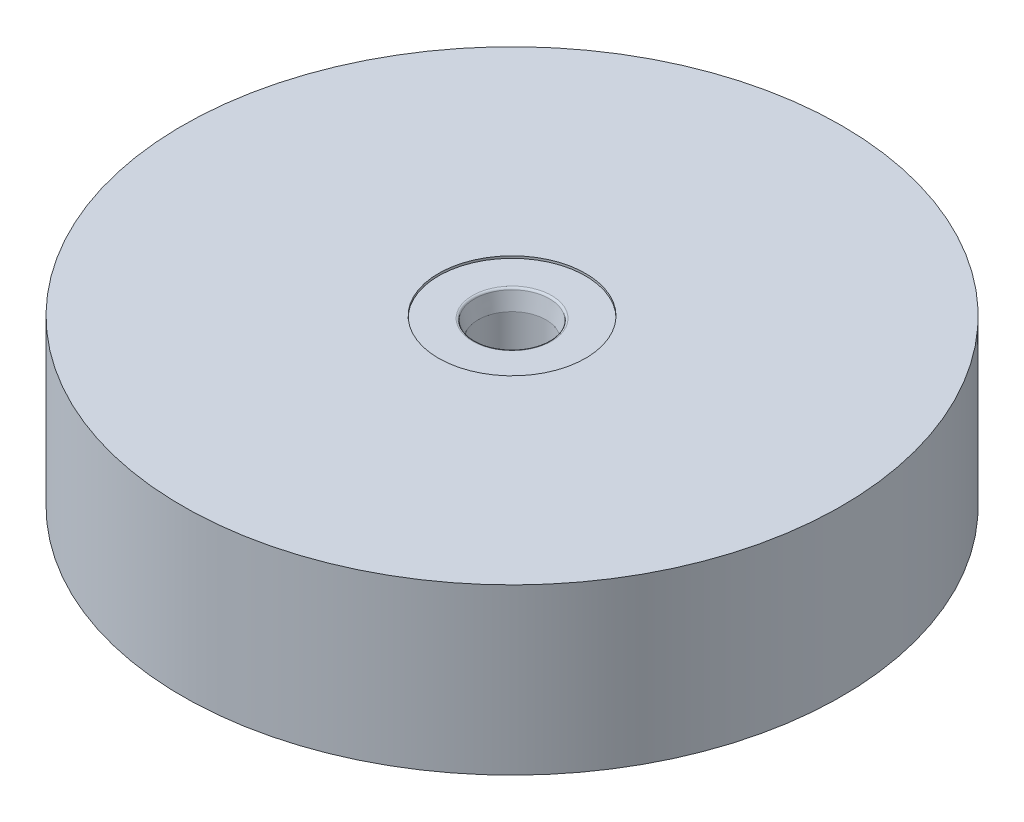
ISO-10303-21;
HEADER;
FILE_DESCRIPTION(('STEP AP214'),'2;1');
FILE_NAME('part.step','',(''),(''),'','','');
FILE_SCHEMA(('AUTOMOTIVE_DESIGN { 1 0 10303 214 1 1 1 1 }'));
ENDSEC;
DATA;
#1=APPLICATION_CONTEXT('core data for automotive mechanical design processes');
#2=APPLICATION_PROTOCOL_DEFINITION('international standard','automotive_design',2000,#1);
#3=PRODUCT_CONTEXT('',#1,'mechanical');
#4=PRODUCT('Part','Part','',(#3));
#5=PRODUCT_RELATED_PRODUCT_CATEGORY('part','',(#4));
#6=PRODUCT_DEFINITION_FORMATION('','',#4);
#7=PRODUCT_DEFINITION_CONTEXT('part definition',#1,'design');
#8=PRODUCT_DEFINITION('design','',#6,#7);
#9=PRODUCT_DEFINITION_SHAPE('','',#8);
#10=(LENGTH_UNIT() NAMED_UNIT(*) SI_UNIT(.MILLI.,.METRE.));
#11=(NAMED_UNIT(*) PLANE_ANGLE_UNIT() SI_UNIT($,.RADIAN.));
#12=(NAMED_UNIT(*) SI_UNIT($,.STERADIAN.) SOLID_ANGLE_UNIT());
#13=UNCERTAINTY_MEASURE_WITH_UNIT(LENGTH_MEASURE(1.E-05),#10,'distance_accuracy_value','');
#14=(GEOMETRIC_REPRESENTATION_CONTEXT(3) GLOBAL_UNCERTAINTY_ASSIGNED_CONTEXT((#13)) GLOBAL_UNIT_ASSIGNED_CONTEXT((#10,
#11,#12)) REPRESENTATION_CONTEXT('',''));
#15=CARTESIAN_POINT('',(0.,0.,0.));
#16=DIRECTION('',(0.,0.,1.));
#17=DIRECTION('',(1.,0.,0.));
#18=AXIS2_PLACEMENT_3D('',#15,#16,#17);
#19=CARTESIAN_POINT('',(-38.1,-19.05,0.));
#20=DIRECTION('',(0.,1.,0.));
#21=DIRECTION('',(0.,0.,1.));
#22=AXIS2_PLACEMENT_3D('',#19,#20,#21);
#23=PLANE('',#22);
#24=CARTESIAN_POINT('',(0.,-19.05,0.));
#25=DIRECTION('',(0.,1.,0.));
#26=DIRECTION('',(0.,0.,1.));
#27=AXIS2_PLACEMENT_3D('',#24,#25,#26);
#28=CIRCLE('',#27,3.4544);
#29=CARTESIAN_POINT('',(0.,-19.05,3.4544));
#30=VERTEX_POINT('',#29);
#31=EDGE_CURVE('E52',#30,#30,#28,.T.);
#32=ORIENTED_EDGE('',*,*,#31,.T.);
#33=EDGE_LOOP('',(#32));
#34=FACE_BOUND('',#33,.T.);
#35=CARTESIAN_POINT('',(0.,-19.05,0.));
#36=DIRECTION('',(0.,-1.,0.));
#37=DIRECTION('',(0.,0.,-1.));
#38=AXIS2_PLACEMENT_3D('',#35,#36,#37);
#39=CIRCLE('',#38,8.5598);
#40=CARTESIAN_POINT('',(0.,-19.05,8.5598));
#41=VERTEX_POINT('',#40);
#42=EDGE_CURVE('E85',#41,#41,#39,.T.);
#43=ORIENTED_EDGE('',*,*,#42,.T.);
#44=EDGE_LOOP('',(#43));
#45=FACE_BOUND('',#44,.T.);
#46=ADVANCED_FACE('F34',(#34,#45),#23,.F.);
#47=CARTESIAN_POINT('',(0.,0.,0.));
#48=DIRECTION('',(0.,-1.,0.));
#49=DIRECTION('',(0.,0.,-1.));
#50=AXIS2_PLACEMENT_3D('',#47,#48,#49);
#51=PLANE('',#50);
#52=CARTESIAN_POINT('',(0.,0.,0.));
#53=DIRECTION('',(0.,1.,0.));
#54=DIRECTION('',(0.,0.,1.));
#55=AXIS2_PLACEMENT_3D('',#52,#53,#54);
#56=CIRCLE('',#55,8.5);
#57=CARTESIAN_POINT('',(0.,0.,8.5));
#58=VERTEX_POINT('',#57);
#59=EDGE_CURVE('E56',#58,#58,#56,.T.);
#60=ORIENTED_EDGE('',*,*,#59,.F.);
#61=EDGE_LOOP('',(#60));
#62=FACE_BOUND('',#61,.T.);
#63=CARTESIAN_POINT('',(0.,0.,0.));
#64=DIRECTION('',(0.,-1.,0.));
#65=DIRECTION('',(0.,0.,-1.));
#66=AXIS2_PLACEMENT_3D('',#63,#64,#65);
#67=CIRCLE('',#66,38.1);
#68=CARTESIAN_POINT('',(0.,0.,-38.1));
#69=VERTEX_POINT('',#68);
#70=EDGE_CURVE('E49',#69,#69,#67,.T.);
#71=ORIENTED_EDGE('',*,*,#70,.F.);
#72=EDGE_LOOP('',(#71));
#73=FACE_BOUND('',#72,.T.);
#74=ADVANCED_FACE('F109',(#62,#73),#51,.F.);
#75=CARTESIAN_POINT('',(0.,0.,0.));
#76=DIRECTION('',(0.,-1.,0.));
#77=DIRECTION('',(0.,0.,-1.));
#78=AXIS2_PLACEMENT_3D('',#75,#76,#77);
#79=CYLINDRICAL_SURFACE('',#78,38.1);
#80=CARTESIAN_POINT('',(0.,-19.05,0.));
#81=DIRECTION('',(0.,-1.,0.));
#82=DIRECTION('',(0.,0.,-1.));
#83=AXIS2_PLACEMENT_3D('',#80,#81,#82);
#84=CIRCLE('',#83,38.1);
#85=CARTESIAN_POINT('',(0.,-19.05,-38.1));
#86=VERTEX_POINT('',#85);
#87=EDGE_CURVE('E55',#86,#86,#84,.T.);
#88=ORIENTED_EDGE('',*,*,#87,.F.);
#89=EDGE_LOOP('',(#88));
#90=FACE_BOUND('',#89,.T.);
#91=ORIENTED_EDGE('',*,*,#70,.T.);
#92=EDGE_LOOP('',(#91));
#93=FACE_BOUND('',#92,.T.);
#94=ADVANCED_FACE('F116',(#90,#93),#79,.T.);
#95=CARTESIAN_POINT('',(0.,-19.05,0.));
#96=DIRECTION('',(0.,1.,0.));
#97=DIRECTION('',(0.,0.,1.));
#98=AXIS2_PLACEMENT_3D('',#95,#96,#97);
#99=CIRCLE('',#98,10.668);
#100=CARTESIAN_POINT('',(0.,-19.05,10.668));
#101=VERTEX_POINT('',#100);
#102=EDGE_CURVE('E45',#101,#101,#99,.F.);
#103=ORIENTED_EDGE('',*,*,#102,.F.);
#104=EDGE_LOOP('',(#103));
#105=FACE_BOUND('',#104,.T.);
#106=ORIENTED_EDGE('',*,*,#87,.T.);
#107=EDGE_LOOP('',(#106));
#108=FACE_BOUND('',#107,.T.);
#109=ADVANCED_FACE('F112',(#105,#108),#23,.F.);
#110=CARTESIAN_POINT('',(0.,0.,0.));
#111=DIRECTION('',(0.,1.,0.));
#112=DIRECTION('',(0.,0.,1.));
#113=AXIS2_PLACEMENT_3D('',#110,#111,#112);
#114=CYLINDRICAL_SURFACE('',#113,3.4544);
#115=CARTESIAN_POINT('',(0.,-10.254,0.));
#116=DIRECTION('',(0.,1.,0.));
#117=DIRECTION('',(0.,0.,1.));
#118=AXIS2_PLACEMENT_3D('',#115,#116,#117);
#119=CIRCLE('',#118,3.4544);
#120=CARTESIAN_POINT('',(0.,-10.254,3.4544));
#121=VERTEX_POINT('',#120);
#122=EDGE_CURVE('E81',#121,#121,#119,.T.);
#123=ORIENTED_EDGE('',*,*,#122,.T.);
#124=EDGE_LOOP('',(#123));
#125=FACE_BOUND('',#124,.T.);
#126=ORIENTED_EDGE('',*,*,#31,.F.);
#127=EDGE_LOOP('',(#126));
#128=FACE_BOUND('',#127,.T.);
#129=ADVANCED_FACE('F122',(#125,#128),#114,.F.);
#130=CARTESIAN_POINT('',(0.,0.,0.));
#131=DIRECTION('',(0.,1.,0.));
#132=DIRECTION('',(0.,0.,1.));
#133=AXIS2_PLACEMENT_3D('',#130,#131,#132);
#134=CYLINDRICAL_SURFACE('',#133,8.5);
#135=CARTESIAN_POINT('',(0.,-0.254000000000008,0.));
#136=DIRECTION('',(0.,1.,0.));
#137=DIRECTION('',(0.,0.,1.));
#138=AXIS2_PLACEMENT_3D('',#135,#136,#137);
#139=CIRCLE('',#138,8.5);
#140=CARTESIAN_POINT('',(0.,-0.254000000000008,8.5));
#141=VERTEX_POINT('',#140);
#142=EDGE_CURVE('E63',#141,#141,#139,.T.);
#143=ORIENTED_EDGE('',*,*,#142,.F.);
#144=EDGE_LOOP('',(#143));
#145=FACE_BOUND('',#144,.T.);
#146=ORIENTED_EDGE('',*,*,#59,.T.);
#147=EDGE_LOOP('',(#146));
#148=FACE_BOUND('',#147,.T.);
#149=ADVANCED_FACE('F128',(#145,#148),#134,.F.);
#150=CARTESIAN_POINT('',(-3.939792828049,-0.254000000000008,-2.32565205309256));
#151=DIRECTION('',(0.,-1.,0.));
#152=DIRECTION('',(0.,0.,-1.));
#153=AXIS2_PLACEMENT_3D('',#150,#151,#152);
#154=PLANE('',#153);
#155=CARTESIAN_POINT('',(0.,-0.254000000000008,0.));
#156=DIRECTION('',(0.,1.,0.));
#157=DIRECTION('',(0.,0.,1.));
#158=AXIS2_PLACEMENT_3D('',#155,#156,#157);
#159=CIRCLE('',#158,4.575);
#160=CARTESIAN_POINT('',(0.,-0.254000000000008,4.575));
#161=VERTEX_POINT('',#160);
#162=EDGE_CURVE('E66',#161,#161,#159,.T.);
#163=ORIENTED_EDGE('',*,*,#162,.F.);
#164=EDGE_LOOP('',(#163));
#165=FACE_BOUND('',#164,.T.);
#166=ORIENTED_EDGE('',*,*,#142,.T.);
#167=EDGE_LOOP('',(#166));
#168=FACE_BOUND('',#167,.T.);
#169=ADVANCED_FACE('F162',(#165,#168),#154,.F.);
#170=CARTESIAN_POINT('',(0.,-0.508000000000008,0.));
#171=DIRECTION('',(0.,1.,0.));
#172=DIRECTION('',(0.,0.,1.));
#173=AXIS2_PLACEMENT_3D('',#170,#171,#172);
#174=TOROIDAL_SURFACE('',#173,4.575,0.254);
#175=CARTESIAN_POINT('',(0.,-0.455190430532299,0.));
#176=DIRECTION('',(0.,1.,0.));
#177=DIRECTION('',(0.,0.,1.));
#178=AXIS2_PLACEMENT_3D('',#175,#176,#177);
#179=CIRCLE('',#178,4.32655050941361);
#180=CARTESIAN_POINT('',(0.,-0.455190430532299,4.32655050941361));
#181=VERTEX_POINT('',#180);
#182=EDGE_CURVE('E69',#181,#181,#179,.T.);
#183=ORIENTED_EDGE('',*,*,#182,.F.);
#184=EDGE_LOOP('',(#183));
#185=FACE_BOUND('',#184,.T.);
#186=ORIENTED_EDGE('',*,*,#162,.T.);
#187=EDGE_LOOP('',(#186));
#188=FACE_BOUND('',#187,.T.);
#189=ADVANCED_FACE('F174',(#185,#188),#174,.T.);
#190=CARTESIAN_POINT('',(0.,-0.455190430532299,0.));
#191=DIRECTION('',(0.,1.,0.));
#192=DIRECTION('',(0.,0.,1.));
#193=AXIS2_PLACEMENT_3D('',#190,#191,#192);
#194=CONICAL_SURFACE('',#193,4.32655050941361,0.209439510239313);
#195=CARTESIAN_POINT('',(0.,-2.35400000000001,0.));
#196=DIRECTION('',(0.,1.,0.));
#197=DIRECTION('',(0.,0.,1.));
#198=AXIS2_PLACEMENT_3D('',#195,#196,#197);
#199=CIRCLE('',#198,3.92294607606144);
#200=CARTESIAN_POINT('',(0.,-2.35400000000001,3.92294607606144));
#201=VERTEX_POINT('',#200);
#202=EDGE_CURVE('E72',#201,#201,#199,.T.);
#203=ORIENTED_EDGE('',*,*,#202,.F.);
#204=EDGE_LOOP('',(#203));
#205=FACE_BOUND('',#204,.T.);
#206=ORIENTED_EDGE('',*,*,#182,.T.);
#207=EDGE_LOOP('',(#206));
#208=FACE_BOUND('',#207,.T.);
#209=ADVANCED_FACE('F185',(#205,#208),#194,.F.);
#210=CARTESIAN_POINT('',(0.,-2.35400000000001,0.));
#211=DIRECTION('',(0.,1.,0.));
#212=DIRECTION('',(0.,0.,1.));
#213=AXIS2_PLACEMENT_3D('',#210,#211,#212);
#214=CONICAL_SURFACE('',#213,3.92294607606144,0.785398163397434);
#215=CARTESIAN_POINT('',(0.,-2.30819607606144,0.));
#216=DIRECTION('',(0.,1.,0.));
#217=DIRECTION('',(0.,0.,1.));
#218=AXIS2_PLACEMENT_3D('',#215,#216,#217);
#219=CIRCLE('',#218,3.96875);
#220=CARTESIAN_POINT('',(0.,-2.30819607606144,3.96875));
#221=VERTEX_POINT('',#220);
#222=EDGE_CURVE('E75',#221,#221,#219,.T.);
#223=ORIENTED_EDGE('',*,*,#222,.F.);
#224=EDGE_LOOP('',(#223));
#225=FACE_BOUND('',#224,.T.);
#226=ORIENTED_EDGE('',*,*,#202,.T.);
#227=EDGE_LOOP('',(#226));
#228=FACE_BOUND('',#227,.T.);
#229=ADVANCED_FACE('F196',(#225,#228),#214,.T.);
#230=CARTESIAN_POINT('',(0.,0.,0.));
#231=DIRECTION('',(0.,1.,0.));
#232=DIRECTION('',(0.,0.,1.));
#233=AXIS2_PLACEMENT_3D('',#230,#231,#232);
#234=CYLINDRICAL_SURFACE('',#233,3.96875);
#235=CARTESIAN_POINT('',(0.,-10.254,0.));
#236=DIRECTION('',(0.,1.,0.));
#237=DIRECTION('',(0.,0.,1.));
#238=AXIS2_PLACEMENT_3D('',#235,#236,#237);
#239=CIRCLE('',#238,3.96875);
#240=CARTESIAN_POINT('',(0.,-10.254,3.96875));
#241=VERTEX_POINT('',#240);
#242=EDGE_CURVE('E78',#241,#241,#239,.T.);
#243=ORIENTED_EDGE('',*,*,#242,.F.);
#244=EDGE_LOOP('',(#243));
#245=FACE_BOUND('',#244,.T.);
#246=ORIENTED_EDGE('',*,*,#222,.T.);
#247=EDGE_LOOP('',(#246));
#248=FACE_BOUND('',#247,.T.);
#249=ADVANCED_FACE('F104',(#245,#248),#234,.F.);
#250=CARTESIAN_POINT('',(-2.97478040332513,-10.254,-1.75600709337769));
#251=DIRECTION('',(0.,-1.,0.));
#252=DIRECTION('',(0.,0.,-1.));
#253=AXIS2_PLACEMENT_3D('',#250,#251,#252);
#254=PLANE('',#253);
#255=ORIENTED_EDGE('',*,*,#122,.F.);
#256=EDGE_LOOP('',(#255));
#257=FACE_BOUND('',#256,.T.);
#258=ORIENTED_EDGE('',*,*,#242,.T.);
#259=EDGE_LOOP('',(#258));
#260=FACE_BOUND('',#259,.T.);
#261=ADVANCED_FACE('F97',(#257,#260),#254,.F.);
#262=CARTESIAN_POINT('',(0.,-38.1,0.));
#263=DIRECTION('',(0.,-1.,0.));
#264=DIRECTION('',(0.,0.,-1.));
#265=AXIS2_PLACEMENT_3D('',#262,#263,#264);
#266=PLANE('',#265);
#267=CARTESIAN_POINT('',(0.,-38.1,0.));
#268=DIRECTION('',(0.,-1.,0.));
#269=DIRECTION('',(0.,0.,-1.));
#270=AXIS2_PLACEMENT_3D('',#267,#268,#269);
#271=CIRCLE('',#270,9.39800000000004);
#272=CARTESIAN_POINT('',(0.,-38.1,9.39800000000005));
#273=VERTEX_POINT('',#272);
#274=EDGE_CURVE('E41',#273,#273,#271,.T.);
#275=ORIENTED_EDGE('',*,*,#274,.T.);
#276=EDGE_LOOP('',(#275));
#277=FACE_BOUND('',#276,.T.);
#278=CARTESIAN_POINT('',(0.,-38.1,0.));
#279=DIRECTION('',(0.,-1.,0.));
#280=DIRECTION('',(0.,0.,-1.));
#281=AXIS2_PLACEMENT_3D('',#278,#279,#280);
#282=CIRCLE('',#281,8.5598);
#283=CARTESIAN_POINT('',(0.,-38.1,8.5598));
#284=VERTEX_POINT('',#283);
#285=EDGE_CURVE('E84',#284,#284,#282,.T.);
#286=ORIENTED_EDGE('',*,*,#285,.F.);
#287=EDGE_LOOP('',(#286));
#288=FACE_BOUND('',#287,.T.);
#289=ADVANCED_FACE('F94',(#277,#288),#266,.T.);
#290=CARTESIAN_POINT('',(0.,-38.1,0.));
#291=DIRECTION('',(0.,1.,0.));
#292=DIRECTION('',(0.,0.,1.));
#293=AXIS2_PLACEMENT_3D('',#290,#291,#292);
#294=CYLINDRICAL_SURFACE('',#293,10.668);
#295=CARTESIAN_POINT('',(0.,-36.83,0.));
#296=DIRECTION('',(0.,-1.,0.));
#297=DIRECTION('',(0.,0.,-1.));
#298=AXIS2_PLACEMENT_3D('',#295,#296,#297);
#299=CIRCLE('',#298,10.668);
#300=CARTESIAN_POINT('',(0.,-36.83,10.668));
#301=VERTEX_POINT('',#300);
#302=EDGE_CURVE('E10',#301,#301,#299,.F.);
#303=CARTESIAN_POINT('',(0.,-36.83,10.668));
#304=CARTESIAN_POINT('',(0.,-36.6447916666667,10.668));
#305=CARTESIAN_POINT('',(0.,-36.4595833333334,10.668));
#306=CARTESIAN_POINT('',(0.,-36.0891666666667,10.668));
#307=CARTESIAN_POINT('',(0.,-35.9039583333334,10.668));
#308=CARTESIAN_POINT('',(0.,-35.5335416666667,10.668));
#309=CARTESIAN_POINT('',(0.,-35.3483333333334,10.668));
#310=CARTESIAN_POINT('',(0.,-34.9779166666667,10.668));
#311=CARTESIAN_POINT('',(0.,-34.7927083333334,10.668));
#312=CARTESIAN_POINT('',(0.,-34.4222916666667,10.668));
#313=CARTESIAN_POINT('',(0.,-34.2370833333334,10.668));
#314=CARTESIAN_POINT('',(0.,-33.8666666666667,10.668));
#315=CARTESIAN_POINT('',(0.,-33.6814583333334,10.668));
#316=CARTESIAN_POINT('',(0.,-33.3110416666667,10.668));
#317=CARTESIAN_POINT('',(0.,-33.1258333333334,10.668));
#318=CARTESIAN_POINT('',(0.,-32.7554166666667,10.668));
#319=CARTESIAN_POINT('',(0.,-32.5702083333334,10.668));
#320=CARTESIAN_POINT('',(0.,-32.1997916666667,10.668));
#321=CARTESIAN_POINT('',(0.,-32.0145833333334,10.668));
#322=CARTESIAN_POINT('',(0.,-31.6441666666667,10.668));
#323=CARTESIAN_POINT('',(0.,-31.4589583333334,10.668));
#324=CARTESIAN_POINT('',(0.,-31.0885416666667,10.668));
#325=CARTESIAN_POINT('',(0.,-30.9033333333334,10.668));
#326=CARTESIAN_POINT('',(0.,-30.5329166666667,10.668));
#327=CARTESIAN_POINT('',(0.,-30.3477083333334,10.668));
#328=CARTESIAN_POINT('',(0.,-29.9772916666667,10.668));
#329=CARTESIAN_POINT('',(0.,-29.7920833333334,10.668));
#330=CARTESIAN_POINT('',(0.,-29.4216666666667,10.668));
#331=CARTESIAN_POINT('',(0.,-29.2364583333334,10.668));
#332=CARTESIAN_POINT('',(0.,-28.8660416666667,10.668));
#333=CARTESIAN_POINT('',(0.,-28.6808333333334,10.668));
#334=CARTESIAN_POINT('',(0.,-28.3104166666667,10.668));
#335=CARTESIAN_POINT('',(0.,-28.1252083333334,10.668));
#336=CARTESIAN_POINT('',(0.,-27.7547916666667,10.668));
#337=CARTESIAN_POINT('',(0.,-27.5695833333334,10.668));
#338=CARTESIAN_POINT('',(0.,-27.1991666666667,10.668));
#339=CARTESIAN_POINT('',(0.,-27.0139583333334,10.668));
#340=CARTESIAN_POINT('',(0.,-26.6435416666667,10.668));
#341=CARTESIAN_POINT('',(0.,-26.4583333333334,10.668));
#342=CARTESIAN_POINT('',(0.,-26.0879166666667,10.668));
#343=CARTESIAN_POINT('',(0.,-25.9027083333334,10.668));
#344=CARTESIAN_POINT('',(0.,-25.5322916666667,10.668));
#345=CARTESIAN_POINT('',(0.,-25.3470833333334,10.668));
#346=CARTESIAN_POINT('',(0.,-24.9766666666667,10.668));
#347=CARTESIAN_POINT('',(0.,-24.7914583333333,10.668));
#348=CARTESIAN_POINT('',(0.,-24.4210416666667,10.668));
#349=CARTESIAN_POINT('',(0.,-24.2358333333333,10.668));
#350=CARTESIAN_POINT('',(0.,-23.8654166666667,10.668));
#351=CARTESIAN_POINT('',(0.,-23.6802083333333,10.668));
#352=CARTESIAN_POINT('',(0.,-23.3097916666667,10.668));
#353=CARTESIAN_POINT('',(0.,-23.1245833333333,10.668));
#354=CARTESIAN_POINT('',(0.,-22.7541666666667,10.668));
#355=CARTESIAN_POINT('',(0.,-22.5689583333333,10.668));
#356=CARTESIAN_POINT('',(0.,-22.1985416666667,10.668));
#357=CARTESIAN_POINT('',(0.,-22.0133333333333,10.668));
#358=CARTESIAN_POINT('',(0.,-21.6429166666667,10.668));
#359=CARTESIAN_POINT('',(0.,-21.4577083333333,10.668));
#360=CARTESIAN_POINT('',(0.,-21.0872916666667,10.668));
#361=CARTESIAN_POINT('',(0.,-20.9020833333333,10.668));
#362=CARTESIAN_POINT('',(0.,-20.5316666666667,10.668));
#363=CARTESIAN_POINT('',(0.,-20.3464583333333,10.668));
#364=CARTESIAN_POINT('',(0.,-19.9760416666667,10.668));
#365=CARTESIAN_POINT('',(0.,-19.7908333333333,10.668));
#366=CARTESIAN_POINT('',(0.,-19.4204166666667,10.668));
#367=CARTESIAN_POINT('',(0.,-19.2352083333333,10.668));
#368=CARTESIAN_POINT('',(0.,-19.05,10.668));
#369=B_SPLINE_CURVE_WITH_KNOTS('',3,(#303,#304,#305,#306,#307,#308,#309,#310,#311,#312,#313,
#314,#315,#316,#317,#318,#319,#320,#321,#322,#323,#324,#325,#326,#327,#328,#329,#330,#331,#332,
#333,#334,#335,#336,#337,#338,#339,#340,#341,#342,#343,#344,#345,#346,#347,#348,#349,#350,#351,
#352,#353,#354,#355,#356,#357,#358,#359,#360,#361,#362,#363,#364,#365,#366,#367,#368),
.UNSPECIFIED.,.F.,.F.,(4,2,2,2,2,2,2,2,2,2,2,2,2,2,2,2,2,2,2,2,2,2,2,2,2,2,2,2,2,2,2,2,4),(0.,
0.555624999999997,1.11125,1.666875,2.2225,2.778125,3.33375,3.88937500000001,4.445,
5.00062500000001,5.55625000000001,6.11187500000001,6.66750000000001,7.22312500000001,
7.77875000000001,8.33437500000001,8.89000000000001,9.44562500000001,10.00125,10.556875,11.1125,
11.668125,12.22375,12.779375,13.335,13.890625,14.44625,15.001875,15.5575,16.113125,16.66875,
17.224375,17.78),.UNSPECIFIED.);
#370=EDGE_CURVE('BSEAM96',#301,#101,#369,.T.);
#371=ORIENTED_EDGE('',*,*,#302,.T.);
#372=ORIENTED_EDGE('',*,*,#102,.T.);
#373=ORIENTED_EDGE('',*,*,#370,.T.);
#374=ORIENTED_EDGE('',*,*,#370,.F.);
#375=EDGE_LOOP('',(#371,#373,#372,#374));
#376=FACE_BOUND('',#375,.T.);
#377=ADVANCED_FACE('F96',(#376),#294,.T.);
#378=CARTESIAN_POINT('',(0.,-38.1,0.));
#379=DIRECTION('',(0.,1.,0.));
#380=DIRECTION('',(0.,0.,1.));
#381=AXIS2_PLACEMENT_3D('',#378,#379,#380);
#382=CYLINDRICAL_SURFACE('',#381,8.5598);
#383=CARTESIAN_POINT('',(0.,-38.1,8.5598));
#384=CARTESIAN_POINT('',(0.,-37.9015625,8.5598));
#385=CARTESIAN_POINT('',(0.,-37.703125,8.5598));
#386=CARTESIAN_POINT('',(0.,-37.30625,8.5598));
#387=CARTESIAN_POINT('',(0.,-37.1078125,8.5598));
#388=CARTESIAN_POINT('',(0.,-36.7109375,8.5598));
#389=CARTESIAN_POINT('',(0.,-36.5125,8.5598));
#390=CARTESIAN_POINT('',(0.,-36.115625,8.5598));
#391=CARTESIAN_POINT('',(0.,-35.9171875,8.5598));
#392=CARTESIAN_POINT('',(0.,-35.5203125,8.5598));
#393=CARTESIAN_POINT('',(0.,-35.321875,8.5598));
#394=CARTESIAN_POINT('',(0.,-34.925,8.5598));
#395=CARTESIAN_POINT('',(0.,-34.7265625,8.5598));
#396=CARTESIAN_POINT('',(0.,-34.3296875,8.5598));
#397=CARTESIAN_POINT('',(0.,-34.13125,8.5598));
#398=CARTESIAN_POINT('',(0.,-33.734375,8.5598));
#399=CARTESIAN_POINT('',(0.,-33.5359375,8.5598));
#400=CARTESIAN_POINT('',(0.,-33.1390625,8.5598));
#401=CARTESIAN_POINT('',(0.,-32.940625,8.5598));
#402=CARTESIAN_POINT('',(0.,-32.54375,8.5598));
#403=CARTESIAN_POINT('',(0.,-32.3453125,8.5598));
#404=CARTESIAN_POINT('',(0.,-31.9484375,8.5598));
#405=CARTESIAN_POINT('',(0.,-31.75,8.5598));
#406=CARTESIAN_POINT('',(0.,-31.353125,8.5598));
#407=CARTESIAN_POINT('',(0.,-31.1546875,8.5598));
#408=CARTESIAN_POINT('',(0.,-30.7578125,8.5598));
#409=CARTESIAN_POINT('',(0.,-30.559375,8.5598));
#410=CARTESIAN_POINT('',(0.,-30.1625,8.5598));
#411=CARTESIAN_POINT('',(0.,-29.9640625,8.5598));
#412=CARTESIAN_POINT('',(0.,-29.5671875,8.5598));
#413=CARTESIAN_POINT('',(0.,-29.36875,8.5598));
#414=CARTESIAN_POINT('',(0.,-28.971875,8.5598));
#415=CARTESIAN_POINT('',(0.,-28.7734375,8.5598));
#416=CARTESIAN_POINT('',(0.,-28.3765625,8.5598));
#417=CARTESIAN_POINT('',(0.,-28.178125,8.5598));
#418=CARTESIAN_POINT('',(0.,-27.78125,8.5598));
#419=CARTESIAN_POINT('',(0.,-27.5828125,8.5598));
#420=CARTESIAN_POINT('',(0.,-27.1859375,8.5598));
#421=CARTESIAN_POINT('',(0.,-26.9875,8.5598));
#422=CARTESIAN_POINT('',(0.,-26.590625,8.5598));
#423=CARTESIAN_POINT('',(0.,-26.3921875,8.5598));
#424=CARTESIAN_POINT('',(0.,-25.9953125,8.5598));
#425=CARTESIAN_POINT('',(0.,-25.796875,8.5598));
#426=CARTESIAN_POINT('',(0.,-25.4,8.5598));
#427=CARTESIAN_POINT('',(0.,-25.2015625,8.5598));
#428=CARTESIAN_POINT('',(0.,-24.8046875,8.5598));
#429=CARTESIAN_POINT('',(0.,-24.60625,8.5598));
#430=CARTESIAN_POINT('',(0.,-24.209375,8.5598));
#431=CARTESIAN_POINT('',(0.,-24.0109375,8.5598));
#432=CARTESIAN_POINT('',(0.,-23.6140625,8.5598));
#433=CARTESIAN_POINT('',(0.,-23.415625,8.5598));
#434=CARTESIAN_POINT('',(0.,-23.01875,8.5598));
#435=CARTESIAN_POINT('',(0.,-22.8203125,8.5598));
#436=CARTESIAN_POINT('',(0.,-22.4234375,8.5598));
#437=CARTESIAN_POINT('',(0.,-22.225,8.5598));
#438=CARTESIAN_POINT('',(0.,-21.828125,8.5598));
#439=CARTESIAN_POINT('',(0.,-21.6296875,8.5598));
#440=CARTESIAN_POINT('',(0.,-21.2328125,8.5598));
#441=CARTESIAN_POINT('',(0.,-21.034375,8.5598));
#442=CARTESIAN_POINT('',(0.,-20.6375,8.5598));
#443=CARTESIAN_POINT('',(0.,-20.4390625,8.5598));
#444=CARTESIAN_POINT('',(0.,-20.0421875,8.5598));
#445=CARTESIAN_POINT('',(0.,-19.84375,8.5598));
#446=CARTESIAN_POINT('',(0.,-19.446875,8.5598));
#447=CARTESIAN_POINT('',(0.,-19.2484375,8.5598));
#448=CARTESIAN_POINT('',(0.,-19.05,8.5598));
#449=B_SPLINE_CURVE_WITH_KNOTS('',3,(#383,#384,#385,#386,#387,#388,#389,#390,#391,#392,#393,
#394,#395,#396,#397,#398,#399,#400,#401,#402,#403,#404,#405,#406,#407,#408,#409,#410,#411,#412,
#413,#414,#415,#416,#417,#418,#419,#420,#421,#422,#423,#424,#425,#426,#427,#428,#429,#430,#431,
#432,#433,#434,#435,#436,#437,#438,#439,#440,#441,#442,#443,#444,#445,#446,#447,#448),
.UNSPECIFIED.,.F.,.F.,(4,2,2,2,2,2,2,2,2,2,2,2,2,2,2,2,2,2,2,2,2,2,2,2,2,2,2,2,2,2,2,2,4),(0.,
0.5953125,1.190625,1.7859375,2.38125,2.9765625,3.571875,4.1671875,4.7625,5.3578125,5.953125,
6.5484375,7.14375,7.7390625,8.334375,8.92968750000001,9.52500000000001,10.1203125,10.715625,
11.3109375,11.90625,12.5015625,13.096875,13.6921875,14.2875,14.8828125,15.478125,16.0734375,
16.66875,17.2640625,17.859375,18.4546875,19.05),.UNSPECIFIED.);
#450=EDGE_CURVE('BSEAM91',#284,#41,#449,.T.);
#451=ORIENTED_EDGE('',*,*,#285,.T.);
#452=ORIENTED_EDGE('',*,*,#42,.F.);
#453=ORIENTED_EDGE('',*,*,#450,.T.);
#454=ORIENTED_EDGE('',*,*,#450,.F.);
#455=EDGE_LOOP('',(#451,#453,#452,#454));
#456=FACE_BOUND('',#455,.T.);
#457=ADVANCED_FACE('F91',(#456),#382,.F.);
#458=CARTESIAN_POINT('',(0.,-38.1,0.));
#459=DIRECTION('',(0.,1.,0.));
#460=DIRECTION('',(0.,0.,1.));
#461=AXIS2_PLACEMENT_3D('',#458,#459,#460);
#462=CONICAL_SURFACE('',#461,9.39800000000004,0.785398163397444);
#463=CARTESIAN_POINT('',(0.,-36.83,10.668));
#464=CARTESIAN_POINT('',(0.,-36.8432291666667,10.6547708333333));
#465=CARTESIAN_POINT('',(0.,-36.8564583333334,10.6415416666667));
#466=CARTESIAN_POINT('',(0.,-36.8829166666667,10.6150833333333));
#467=CARTESIAN_POINT('',(0.,-36.8961458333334,10.6018541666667));
#468=CARTESIAN_POINT('',(0.,-36.9226041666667,10.5753958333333));
#469=CARTESIAN_POINT('',(0.,-36.9358333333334,10.5621666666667));
#470=CARTESIAN_POINT('',(0.,-36.9622916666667,10.5357083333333));
#471=CARTESIAN_POINT('',(0.,-36.9755208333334,10.5224791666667));
#472=CARTESIAN_POINT('',(0.,-37.0019791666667,10.4960208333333));
#473=CARTESIAN_POINT('',(0.,-37.0152083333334,10.4827916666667));
#474=CARTESIAN_POINT('',(0.,-37.0416666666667,10.4563333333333));
#475=CARTESIAN_POINT('',(0.,-37.0548958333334,10.4431041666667));
#476=CARTESIAN_POINT('',(0.,-37.0813541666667,10.4166458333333));
#477=CARTESIAN_POINT('',(0.,-37.0945833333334,10.4034166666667));
#478=CARTESIAN_POINT('',(0.,-37.1210416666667,10.3769583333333));
#479=CARTESIAN_POINT('',(0.,-37.1342708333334,10.3637291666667));
#480=CARTESIAN_POINT('',(0.,-37.1607291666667,10.3372708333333));
#481=CARTESIAN_POINT('',(0.,-37.1739583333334,10.3240416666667));
#482=CARTESIAN_POINT('',(0.,-37.2004166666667,10.2975833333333));
#483=CARTESIAN_POINT('',(0.,-37.2136458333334,10.2843541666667));
#484=CARTESIAN_POINT('',(0.,-37.2401041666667,10.2578958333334));
#485=CARTESIAN_POINT('',(0.,-37.2533333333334,10.2446666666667));
#486=CARTESIAN_POINT('',(0.,-37.2797916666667,10.2182083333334));
#487=CARTESIAN_POINT('',(0.,-37.2930208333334,10.2049791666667));
#488=CARTESIAN_POINT('',(0.,-37.3194791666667,10.1785208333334));
#489=CARTESIAN_POINT('',(0.,-37.3327083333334,10.1652916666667));
#490=CARTESIAN_POINT('',(0.,-37.3591666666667,10.1388333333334));
#491=CARTESIAN_POINT('',(0.,-37.3723958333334,10.1256041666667));
#492=CARTESIAN_POINT('',(0.,-37.3988541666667,10.0991458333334));
#493=CARTESIAN_POINT('',(0.,-37.4120833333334,10.0859166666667));
#494=CARTESIAN_POINT('',(0.,-37.4385416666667,10.0594583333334));
#495=CARTESIAN_POINT('',(0.,-37.4517708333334,10.0462291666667));
#496=CARTESIAN_POINT('',(0.,-37.4782291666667,10.0197708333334));
#497=CARTESIAN_POINT('',(0.,-37.4914583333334,10.0065416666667));
#498=CARTESIAN_POINT('',(0.,-37.5179166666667,9.98008333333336));
#499=CARTESIAN_POINT('',(0.,-37.5311458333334,9.96685416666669));
#500=CARTESIAN_POINT('',(0.,-37.5576041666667,9.94039583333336));
#501=CARTESIAN_POINT('',(0.,-37.5708333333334,9.92716666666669));
#502=CARTESIAN_POINT('',(0.,-37.5972916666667,9.90070833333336));
#503=CARTESIAN_POINT('',(0.,-37.6105208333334,9.8874791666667));
#504=CARTESIAN_POINT('',(0.,-37.6369791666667,9.86102083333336));
#505=CARTESIAN_POINT('',(0.,-37.6502083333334,9.8477916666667));
#506=CARTESIAN_POINT('',(0.,-37.6766666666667,9.82133333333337));
#507=CARTESIAN_POINT('',(0.,-37.6898958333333,9.8081041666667));
#508=CARTESIAN_POINT('',(0.,-37.7163541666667,9.78164583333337));
#509=CARTESIAN_POINT('',(0.,-37.7295833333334,9.7684166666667));
#510=CARTESIAN_POINT('',(0.,-37.7560416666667,9.74195833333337));
#511=CARTESIAN_POINT('',(0.,-37.7692708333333,9.7287291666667));
#512=CARTESIAN_POINT('',(0.,-37.7957291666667,9.70227083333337));
#513=CARTESIAN_POINT('',(0.,-37.8089583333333,9.6890416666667));
#514=CARTESIAN_POINT('',(0.,-37.8354166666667,9.66258333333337));
#515=CARTESIAN_POINT('',(0.,-37.8486458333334,9.6493541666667));
#516=CARTESIAN_POINT('',(0.,-37.8751041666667,9.62289583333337));
#517=CARTESIAN_POINT('',(0.,-37.8883333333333,9.60966666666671));
#518=CARTESIAN_POINT('',(0.,-37.9147916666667,9.58320833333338));
#519=CARTESIAN_POINT('',(0.,-37.9280208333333,9.56997916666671));
#520=CARTESIAN_POINT('',(0.,-37.9544791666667,9.54352083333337));
#521=CARTESIAN_POINT('',(0.,-37.9677083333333,9.53029166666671));
#522=CARTESIAN_POINT('',(0.,-37.9941666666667,9.50383333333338));
#523=CARTESIAN_POINT('',(0.,-38.0073958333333,9.49060416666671));
#524=CARTESIAN_POINT('',(0.,-38.0338541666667,9.46414583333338));
#525=CARTESIAN_POINT('',(0.,-38.0470833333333,9.45091666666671));
#526=CARTESIAN_POINT('',(0.,-38.0735416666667,9.42445833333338));
#527=CARTESIAN_POINT('',(0.,-38.0867708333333,9.41122916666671));
#528=CARTESIAN_POINT('',(0.,-38.1,9.39800000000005));
#529=B_SPLINE_CURVE_WITH_KNOTS('',3,(#463,#464,#465,#466,#467,#468,#469,#470,#471,#472,#473,
#474,#475,#476,#477,#478,#479,#480,#481,#482,#483,#484,#485,#486,#487,#488,#489,#490,#491,#492,
#493,#494,#495,#496,#497,#498,#499,#500,#501,#502,#503,#504,#505,#506,#507,#508,#509,#510,#511,
#512,#513,#514,#515,#516,#517,#518,#519,#520,#521,#522,#523,#524,#525,#526,#527,#528),
.UNSPECIFIED.,.F.,.F.,(4,2,2,2,2,2,2,2,2,2,2,2,2,2,2,2,2,2,2,2,2,2,2,2,2,2,2,2,2,2,2,2,4),(0.,
0.0561266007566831,0.112253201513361,0.168379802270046,0.224506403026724,0.280633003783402,
0.336759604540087,0.392886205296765,0.449012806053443,0.505139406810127,0.561266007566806,
0.617392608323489,0.673519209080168,0.729645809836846,0.785772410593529,0.841899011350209,
0.898025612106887,0.95415221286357,1.01027881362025,1.06640541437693,1.12253201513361,
1.17865861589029,1.23478521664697,1.29091181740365,1.34703841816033,1.40316501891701,
1.45929161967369,1.51541822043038,1.57154482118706,1.62767142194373,1.68379802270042,
1.7399246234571,1.79605122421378),.UNSPECIFIED.);
#530=EDGE_CURVE('BSEAM36',#301,#273,#529,.T.);
#531=ORIENTED_EDGE('',*,*,#302,.F.);
#532=ORIENTED_EDGE('',*,*,#274,.F.);
#533=ORIENTED_EDGE('',*,*,#530,.T.);
#534=ORIENTED_EDGE('',*,*,#530,.F.);
#535=EDGE_LOOP('',(#531,#533,#532,#534));
#536=FACE_BOUND('',#535,.T.);
#537=ADVANCED_FACE('F36',(#536),#462,.T.);
#538=CLOSED_SHELL('',(#46,#74,#94,#109,#129,#149,#169,#189,#209,#229,#249,#261,#289,#377,#457,#537));
#539=MANIFOLD_SOLID_BREP('B2',#538);
#540=ADVANCED_BREP_SHAPE_REPRESENTATION('',(#18,#539),#14);
#541=SHAPE_DEFINITION_REPRESENTATION(#9,#540);
ENDSEC;
END-ISO-10303-21;
